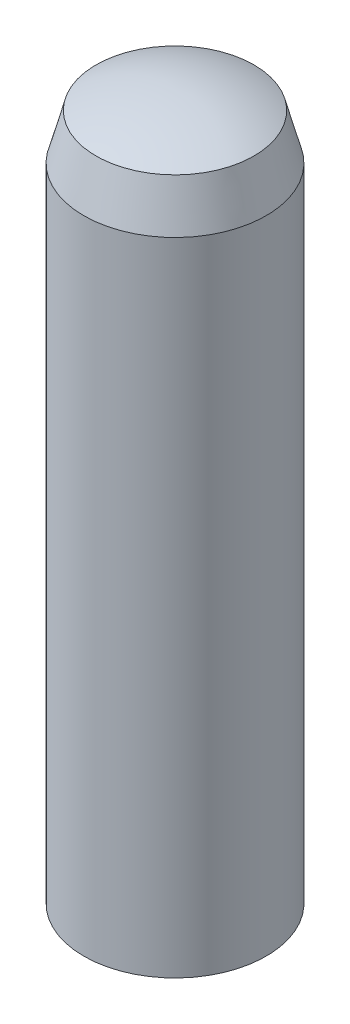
from build123d import *


with BuildPart() as part:
    # Esquisse1 → Base-R_volution (revolve)
    with BuildSketch(Plane.XY, mode=Mode.PRIVATE) as base_r_volution_sk:
        with BuildLine():
            Line((-3, 0.803847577), (-3, 21.9))
            Line((-3, 21.9), (-2.598076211, 23.4))
            ThreePointArc((-2.598076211, 23.4), (-1.333229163, 23.848051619), (0, 24))
            Line((0, 24), (0, 0))
            ThreePointArc((0, 0), (-1.552914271, 0.204445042), (-3, 0.803847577))
        make_face()
    revolve(base_r_volution_sk.sketch.rotate(Axis((0, 0, 0), (0, 1, 0)), 270), axis=Axis((0, 0, 0), (0, 1, 0)))


solid = part.part
